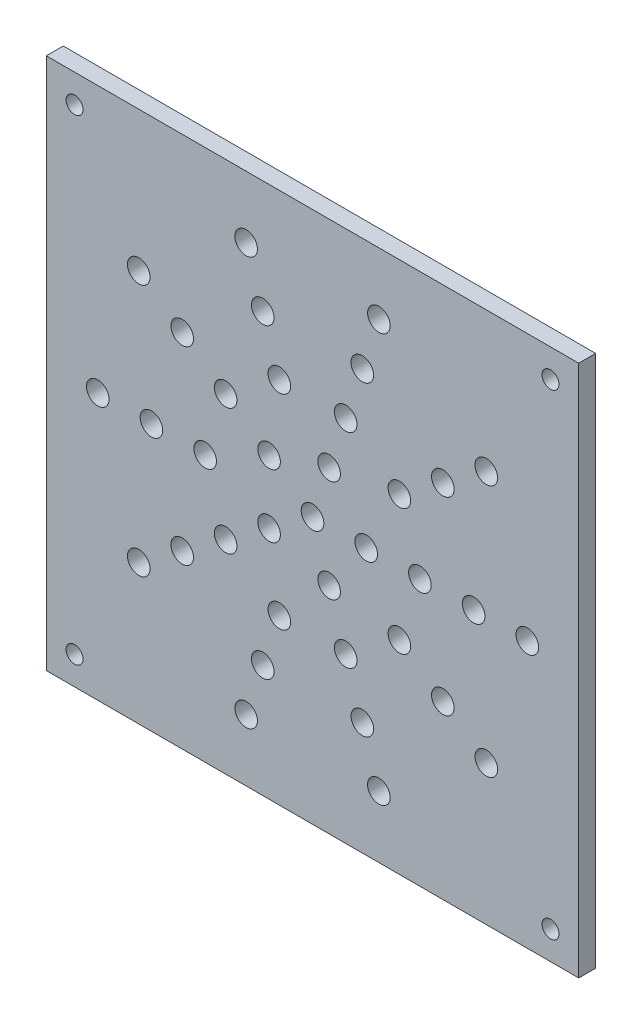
ISO-10303-21;
HEADER;
FILE_DESCRIPTION(('STEP AP214'),'2;1');
FILE_NAME('part.step','',(''),(''),'','','');
FILE_SCHEMA(('AUTOMOTIVE_DESIGN { 1 0 10303 214 1 1 1 1 }'));
ENDSEC;
DATA;
#1=APPLICATION_CONTEXT('core data for automotive mechanical design processes');
#2=APPLICATION_PROTOCOL_DEFINITION('international standard','automotive_design',2000,#1);
#3=PRODUCT_CONTEXT('',#1,'mechanical');
#4=PRODUCT('Part','Part','',(#3));
#5=PRODUCT_RELATED_PRODUCT_CATEGORY('part','',(#4));
#6=PRODUCT_DEFINITION_FORMATION('','',#4);
#7=PRODUCT_DEFINITION_CONTEXT('part definition',#1,'design');
#8=PRODUCT_DEFINITION('design','',#6,#7);
#9=PRODUCT_DEFINITION_SHAPE('','',#8);
#10=(LENGTH_UNIT() NAMED_UNIT(*) SI_UNIT(.MILLI.,.METRE.));
#11=(NAMED_UNIT(*) PLANE_ANGLE_UNIT() SI_UNIT($,.RADIAN.));
#12=(NAMED_UNIT(*) SI_UNIT($,.STERADIAN.) SOLID_ANGLE_UNIT());
#13=UNCERTAINTY_MEASURE_WITH_UNIT(LENGTH_MEASURE(1.E-05),#10,'distance_accuracy_value','');
#14=(GEOMETRIC_REPRESENTATION_CONTEXT(3) GLOBAL_UNCERTAINTY_ASSIGNED_CONTEXT((#13)) GLOBAL_UNIT_ASSIGNED_CONTEXT((#10,
#11,#12)) REPRESENTATION_CONTEXT('',''));
#15=CARTESIAN_POINT('',(0.,0.,0.));
#16=DIRECTION('',(0.,0.,1.));
#17=DIRECTION('',(1.,0.,0.));
#18=AXIS2_PLACEMENT_3D('',#15,#16,#17);
#19=CARTESIAN_POINT('',(89.2000000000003,-3.15388196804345E-13,3.));
#20=DIRECTION('',(1.,0.,0.));
#21=DIRECTION('',(0.,1.,0.));
#22=AXIS2_PLACEMENT_3D('',#19,#20,#21);
#23=PLANE('',#22);
#24=DIRECTION('',(0.,-1.,0.));
#25=VECTOR('',#24,1.);
#26=CARTESIAN_POINT('',(89.2000000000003,-3.15388196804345E-13,0.));
#27=LINE('',#26,#25);
#28=CARTESIAN_POINT('',(89.2000000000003,4.99999999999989,0.));
#29=VERTEX_POINT('',#28);
#30=CARTESIAN_POINT('',(89.2,-89.2000000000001,0.));
#31=VERTEX_POINT('',#30);
#32=EDGE_CURVE('E231',#29,#31,#27,.T.);
#33=ORIENTED_EDGE('',*,*,#32,.F.);
#34=DIRECTION('',(0.,0.,-1.));
#35=VECTOR('',#34,1.);
#36=CARTESIAN_POINT('',(89.2000000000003,4.99999999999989,3.));
#37=LINE('',#36,#35);
#38=CARTESIAN_POINT('',(89.2000000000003,4.99999999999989,3.));
#39=VERTEX_POINT('',#38);
#40=EDGE_CURVE('E11',#39,#29,#37,.T.);
#41=ORIENTED_EDGE('',*,*,#40,.F.);
#42=DIRECTION('',(0.,-1.,0.));
#43=VECTOR('',#42,1.);
#44=CARTESIAN_POINT('',(89.2000000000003,-3.15388196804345E-13,3.));
#45=LINE('',#44,#43);
#46=CARTESIAN_POINT('',(89.2,-89.2000000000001,3.));
#47=VERTEX_POINT('',#46);
#48=EDGE_CURVE('E96',#39,#47,#45,.T.);
#49=ORIENTED_EDGE('',*,*,#48,.T.);
#50=DIRECTION('',(0.,0.,-1.));
#51=VECTOR('',#50,1.);
#52=CARTESIAN_POINT('',(89.2,-89.2000000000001,3.));
#53=LINE('',#52,#51);
#54=EDGE_CURVE('E64',#47,#31,#53,.T.);
#55=ORIENTED_EDGE('',*,*,#54,.T.);
#56=EDGE_LOOP('',(#33,#41,#49,#55));
#57=FACE_BOUND('',#56,.T.);
#58=ADVANCED_FACE('F47',(#57),#23,.T.);
#59=CARTESIAN_POINT('',(0.,5.0000000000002,3.));
#60=DIRECTION('',(0.,-1.,0.));
#61=DIRECTION('',(1.,0.,0.));
#62=AXIS2_PLACEMENT_3D('',#59,#60,#61);
#63=PLANE('',#62);
#64=DIRECTION('',(-1.,0.,0.));
#65=VECTOR('',#64,1.);
#66=CARTESIAN_POINT('',(0.,5.0000000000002,0.));
#67=LINE('',#66,#65);
#68=CARTESIAN_POINT('',(-4.99999999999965,5.00000000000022,0.));
#69=VERTEX_POINT('',#68);
#70=EDGE_CURVE('E102',#29,#69,#67,.T.);
#71=ORIENTED_EDGE('',*,*,#70,.T.);
#72=DIRECTION('',(0.,0.,-1.));
#73=VECTOR('',#72,1.);
#74=CARTESIAN_POINT('',(-4.99999999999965,5.00000000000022,3.));
#75=LINE('',#74,#73);
#76=CARTESIAN_POINT('',(-4.99999999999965,5.00000000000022,3.));
#77=VERTEX_POINT('',#76);
#78=EDGE_CURVE('E56',#77,#69,#75,.T.);
#79=ORIENTED_EDGE('',*,*,#78,.F.);
#80=DIRECTION('',(-1.,0.,0.));
#81=VECTOR('',#80,1.);
#82=CARTESIAN_POINT('',(0.,5.0000000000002,3.));
#83=LINE('',#82,#81);
#84=EDGE_CURVE('E90',#39,#77,#83,.T.);
#85=ORIENTED_EDGE('',*,*,#84,.F.);
#86=ORIENTED_EDGE('',*,*,#40,.T.);
#87=EDGE_LOOP('',(#71,#79,#85,#86));
#88=FACE_BOUND('',#87,.T.);
#89=ADVANCED_FACE('F100',(#88),#63,.F.);
#90=CARTESIAN_POINT('',(-4.99999999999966,0.,3.));
#91=DIRECTION('',(-1.,0.,0.));
#92=DIRECTION('',(0.,-1.,0.));
#93=AXIS2_PLACEMENT_3D('',#90,#91,#92);
#94=PLANE('',#93);
#95=DIRECTION('',(0.,1.,0.));
#96=VECTOR('',#95,1.);
#97=CARTESIAN_POINT('',(-4.99999999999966,0.,0.));
#98=LINE('',#97,#96);
#99=CARTESIAN_POINT('',(-4.99999999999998,-89.1999999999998,0.));
#100=VERTEX_POINT('',#99);
#101=EDGE_CURVE('E234',#100,#69,#98,.T.);
#102=ORIENTED_EDGE('',*,*,#101,.F.);
#103=DIRECTION('',(0.,0.,-1.));
#104=VECTOR('',#103,1.);
#105=CARTESIAN_POINT('',(-4.99999999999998,-89.1999999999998,3.));
#106=LINE('',#105,#104);
#107=CARTESIAN_POINT('',(-4.99999999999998,-89.1999999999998,3.));
#108=VERTEX_POINT('',#107);
#109=EDGE_CURVE('E77',#108,#100,#106,.T.);
#110=ORIENTED_EDGE('',*,*,#109,.F.);
#111=DIRECTION('',(0.,1.,0.));
#112=VECTOR('',#111,1.);
#113=CARTESIAN_POINT('',(-4.99999999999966,0.,3.));
#114=LINE('',#113,#112);
#115=EDGE_CURVE('E95',#108,#77,#114,.T.);
#116=ORIENTED_EDGE('',*,*,#115,.T.);
#117=ORIENTED_EDGE('',*,*,#78,.T.);
#118=EDGE_LOOP('',(#102,#110,#116,#117));
#119=FACE_BOUND('',#118,.T.);
#120=ADVANCED_FACE('F105',(#119),#94,.T.);
#121=CARTESIAN_POINT('',(0.,0.,3.));
#122=DIRECTION('',(0.,0.,-1.));
#123=DIRECTION('',(-1.,0.,0.));
#124=AXIS2_PLACEMENT_3D('',#121,#122,#123);
#125=CYLINDRICAL_SURFACE('',#124,1.5);
#126=CARTESIAN_POINT('',(0.,0.,3.));
#127=DIRECTION('',(0.,0.,1.));
#128=DIRECTION('',(1.,0.,0.));
#129=AXIS2_PLACEMENT_3D('',#126,#127,#128);
#130=CIRCLE('',#129,1.5);
#131=CARTESIAN_POINT('',(1.50000000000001,0.,3.));
#132=VERTEX_POINT('',#131);
#133=EDGE_CURVE('E361',#132,#132,#130,.T.);
#134=ORIENTED_EDGE('',*,*,#133,.T.);
#135=EDGE_LOOP('',(#134));
#136=FACE_BOUND('',#135,.T.);
#137=CARTESIAN_POINT('',(0.,0.,0.));
#138=DIRECTION('',(0.,0.,1.));
#139=DIRECTION('',(1.,0.,0.));
#140=AXIS2_PLACEMENT_3D('',#137,#138,#139);
#141=CIRCLE('',#140,1.5);
#142=CARTESIAN_POINT('',(1.50000000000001,0.,0.));
#143=VERTEX_POINT('',#142);
#144=EDGE_CURVE('E228',#143,#143,#141,.T.);
#145=ORIENTED_EDGE('',*,*,#144,.F.);
#146=EDGE_LOOP('',(#145));
#147=FACE_BOUND('',#146,.T.);
#148=ADVANCED_FACE('F383',(#136,#147),#125,.F.);
#149=CARTESIAN_POINT('',(8.83731317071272E-13,-84.2,3.));
#150=DIRECTION('',(0.,0.,-1.));
#151=DIRECTION('',(-1.,0.,0.));
#152=AXIS2_PLACEMENT_3D('',#149,#150,#151);
#153=CYLINDRICAL_SURFACE('',#152,1.5);
#154=CARTESIAN_POINT('',(8.83731317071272E-13,-84.2,3.));
#155=DIRECTION('',(0.,0.,1.));
#156=DIRECTION('',(1.,0.,0.));
#157=AXIS2_PLACEMENT_3D('',#154,#155,#156);
#158=CIRCLE('',#157,1.5);
#159=CARTESIAN_POINT('',(1.50000000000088,-84.2,3.));
#160=VERTEX_POINT('',#159);
#161=EDGE_CURVE('E358',#160,#160,#158,.T.);
#162=ORIENTED_EDGE('',*,*,#161,.T.);
#163=EDGE_LOOP('',(#162));
#164=FACE_BOUND('',#163,.T.);
#165=CARTESIAN_POINT('',(8.83731317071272E-13,-84.2,0.));
#166=DIRECTION('',(0.,0.,1.));
#167=DIRECTION('',(1.,0.,0.));
#168=AXIS2_PLACEMENT_3D('',#165,#166,#167);
#169=CIRCLE('',#168,1.5);
#170=CARTESIAN_POINT('',(1.50000000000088,-84.2,0.));
#171=VERTEX_POINT('',#170);
#172=EDGE_CURVE('E225',#171,#171,#169,.T.);
#173=ORIENTED_EDGE('',*,*,#172,.F.);
#174=EDGE_LOOP('',(#173));
#175=FACE_BOUND('',#174,.T.);
#176=ADVANCED_FACE('F386',(#164,#175),#153,.F.);
#177=CARTESIAN_POINT('',(84.2000000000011,-84.1999999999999,3.));
#178=DIRECTION('',(0.,0.,-1.));
#179=DIRECTION('',(-1.,0.,0.));
#180=AXIS2_PLACEMENT_3D('',#177,#178,#179);
#181=CYLINDRICAL_SURFACE('',#180,1.5);
#182=CARTESIAN_POINT('',(84.2000000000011,-84.1999999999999,3.));
#183=DIRECTION('',(0.,0.,1.));
#184=DIRECTION('',(1.,0.,0.));
#185=AXIS2_PLACEMENT_3D('',#182,#183,#184);
#186=CIRCLE('',#185,1.5);
#187=CARTESIAN_POINT('',(85.7000000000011,-84.1999999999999,3.));
#188=VERTEX_POINT('',#187);
#189=EDGE_CURVE('E355',#188,#188,#186,.T.);
#190=ORIENTED_EDGE('',*,*,#189,.T.);
#191=EDGE_LOOP('',(#190));
#192=FACE_BOUND('',#191,.T.);
#193=CARTESIAN_POINT('',(84.2000000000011,-84.1999999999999,0.));
#194=DIRECTION('',(0.,0.,1.));
#195=DIRECTION('',(1.,0.,0.));
#196=AXIS2_PLACEMENT_3D('',#193,#194,#195);
#197=CIRCLE('',#196,1.5);
#198=CARTESIAN_POINT('',(85.7000000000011,-84.1999999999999,0.));
#199=VERTEX_POINT('',#198);
#200=EDGE_CURVE('E222',#199,#199,#197,.T.);
#201=ORIENTED_EDGE('',*,*,#200,.F.);
#202=EDGE_LOOP('',(#201));
#203=FACE_BOUND('',#202,.T.);
#204=ADVANCED_FACE('F390',(#192,#203),#181,.F.);
#205=CARTESIAN_POINT('',(84.2000000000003,0.,3.));
#206=DIRECTION('',(0.,0.,-1.));
#207=DIRECTION('',(-1.,0.,0.));
#208=AXIS2_PLACEMENT_3D('',#205,#206,#207);
#209=CYLINDRICAL_SURFACE('',#208,1.5);
#210=CARTESIAN_POINT('',(84.2000000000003,0.,3.));
#211=DIRECTION('',(0.,0.,1.));
#212=DIRECTION('',(1.,0.,0.));
#213=AXIS2_PLACEMENT_3D('',#210,#211,#212);
#214=CIRCLE('',#213,1.5);
#215=CARTESIAN_POINT('',(85.7000000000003,0.,3.));
#216=VERTEX_POINT('',#215);
#217=EDGE_CURVE('E352',#216,#216,#214,.T.);
#218=ORIENTED_EDGE('',*,*,#217,.T.);
#219=EDGE_LOOP('',(#218));
#220=FACE_BOUND('',#219,.T.);
#221=CARTESIAN_POINT('',(84.2000000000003,0.,0.));
#222=DIRECTION('',(0.,0.,1.));
#223=DIRECTION('',(1.,0.,0.));
#224=AXIS2_PLACEMENT_3D('',#221,#222,#223);
#225=CIRCLE('',#224,1.5);
#226=CARTESIAN_POINT('',(85.7000000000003,0.,0.));
#227=VERTEX_POINT('',#226);
#228=EDGE_CURVE('E219',#227,#227,#225,.T.);
#229=ORIENTED_EDGE('',*,*,#228,.F.);
#230=EDGE_LOOP('',(#229));
#231=FACE_BOUND('',#230,.T.);
#232=ADVANCED_FACE('F394',(#220,#231),#209,.F.);
#233=CARTESIAN_POINT('',(42.1000000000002,-42.1,3.));
#234=DIRECTION('',(0.,0.,-1.));
#235=DIRECTION('',(-1.,0.,0.));
#236=AXIS2_PLACEMENT_3D('',#233,#234,#235);
#237=CYLINDRICAL_SURFACE('',#236,2.);
#238=CARTESIAN_POINT('',(42.1000000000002,-42.1,3.));
#239=DIRECTION('',(0.,0.,1.));
#240=DIRECTION('',(1.,0.,0.));
#241=AXIS2_PLACEMENT_3D('',#238,#239,#240);
#242=CIRCLE('',#241,2.);
#243=CARTESIAN_POINT('',(44.1000000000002,-42.1,3.));
#244=VERTEX_POINT('',#243);
#245=EDGE_CURVE('E349',#244,#244,#242,.T.);
#246=ORIENTED_EDGE('',*,*,#245,.T.);
#247=EDGE_LOOP('',(#246));
#248=FACE_BOUND('',#247,.T.);
#249=CARTESIAN_POINT('',(42.1000000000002,-42.1,0.));
#250=DIRECTION('',(0.,0.,1.));
#251=DIRECTION('',(1.,0.,0.));
#252=AXIS2_PLACEMENT_3D('',#249,#250,#251);
#253=CIRCLE('',#252,2.);
#254=CARTESIAN_POINT('',(44.1000000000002,-42.1,0.));
#255=VERTEX_POINT('',#254);
#256=EDGE_CURVE('E216',#255,#255,#253,.T.);
#257=ORIENTED_EDGE('',*,*,#256,.F.);
#258=EDGE_LOOP('',(#257));
#259=FACE_BOUND('',#258,.T.);
#260=ADVANCED_FACE('F398',(#248,#259),#237,.F.);
#261=CARTESIAN_POINT('',(51.6000000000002,-42.1,3.));
#262=DIRECTION('',(0.,0.,-1.));
#263=DIRECTION('',(-1.,0.,0.));
#264=AXIS2_PLACEMENT_3D('',#261,#262,#263);
#265=CYLINDRICAL_SURFACE('',#264,2.);
#266=CARTESIAN_POINT('',(51.6000000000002,-42.1,3.));
#267=DIRECTION('',(0.,0.,1.));
#268=DIRECTION('',(1.,0.,0.));
#269=AXIS2_PLACEMENT_3D('',#266,#267,#268);
#270=CIRCLE('',#269,2.);
#271=CARTESIAN_POINT('',(53.6000000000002,-42.1,3.));
#272=VERTEX_POINT('',#271);
#273=EDGE_CURVE('E346',#272,#272,#270,.T.);
#274=ORIENTED_EDGE('',*,*,#273,.T.);
#275=EDGE_LOOP('',(#274));
#276=FACE_BOUND('',#275,.T.);
#277=CARTESIAN_POINT('',(51.6000000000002,-42.1,0.));
#278=DIRECTION('',(0.,0.,1.));
#279=DIRECTION('',(1.,0.,0.));
#280=AXIS2_PLACEMENT_3D('',#277,#278,#279);
#281=CIRCLE('',#280,2.);
#282=CARTESIAN_POINT('',(53.6000000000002,-42.1,0.));
#283=VERTEX_POINT('',#282);
#284=EDGE_CURVE('E213',#283,#283,#281,.T.);
#285=ORIENTED_EDGE('',*,*,#284,.F.);
#286=EDGE_LOOP('',(#285));
#287=FACE_BOUND('',#286,.T.);
#288=ADVANCED_FACE('F402',(#276,#287),#265,.F.);
#289=CARTESIAN_POINT('',(61.1000000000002,-42.1,3.));
#290=DIRECTION('',(0.,0.,-1.));
#291=DIRECTION('',(-1.,0.,0.));
#292=AXIS2_PLACEMENT_3D('',#289,#290,#291);
#293=CYLINDRICAL_SURFACE('',#292,2.);
#294=CARTESIAN_POINT('',(61.1000000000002,-42.1,3.));
#295=DIRECTION('',(0.,0.,1.));
#296=DIRECTION('',(1.,0.,0.));
#297=AXIS2_PLACEMENT_3D('',#294,#295,#296);
#298=CIRCLE('',#297,2.);
#299=CARTESIAN_POINT('',(63.1000000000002,-42.1,3.));
#300=VERTEX_POINT('',#299);
#301=EDGE_CURVE('E343',#300,#300,#298,.T.);
#302=ORIENTED_EDGE('',*,*,#301,.T.);
#303=EDGE_LOOP('',(#302));
#304=FACE_BOUND('',#303,.T.);
#305=CARTESIAN_POINT('',(61.1000000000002,-42.1,0.));
#306=DIRECTION('',(0.,0.,1.));
#307=DIRECTION('',(1.,0.,0.));
#308=AXIS2_PLACEMENT_3D('',#305,#306,#307);
#309=CIRCLE('',#308,2.);
#310=CARTESIAN_POINT('',(63.1000000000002,-42.1,0.));
#311=VERTEX_POINT('',#310);
#312=EDGE_CURVE('E210',#311,#311,#309,.T.);
#313=ORIENTED_EDGE('',*,*,#312,.F.);
#314=EDGE_LOOP('',(#313));
#315=FACE_BOUND('',#314,.T.);
#316=ADVANCED_FACE('F406',(#304,#315),#293,.F.);
#317=CARTESIAN_POINT('',(70.6000000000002,-42.1,3.));
#318=DIRECTION('',(0.,0.,-1.));
#319=DIRECTION('',(-1.,0.,0.));
#320=AXIS2_PLACEMENT_3D('',#317,#318,#319);
#321=CYLINDRICAL_SURFACE('',#320,2.);
#322=CARTESIAN_POINT('',(70.6000000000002,-42.1,3.));
#323=DIRECTION('',(0.,0.,1.));
#324=DIRECTION('',(1.,0.,0.));
#325=AXIS2_PLACEMENT_3D('',#322,#323,#324);
#326=CIRCLE('',#325,2.);
#327=CARTESIAN_POINT('',(72.6000000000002,-42.1,3.));
#328=VERTEX_POINT('',#327);
#329=EDGE_CURVE('E340',#328,#328,#326,.T.);
#330=ORIENTED_EDGE('',*,*,#329,.T.);
#331=EDGE_LOOP('',(#330));
#332=FACE_BOUND('',#331,.T.);
#333=CARTESIAN_POINT('',(70.6000000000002,-42.1,0.));
#334=DIRECTION('',(0.,0.,1.));
#335=DIRECTION('',(1.,0.,0.));
#336=AXIS2_PLACEMENT_3D('',#333,#334,#335);
#337=CIRCLE('',#336,2.);
#338=CARTESIAN_POINT('',(72.6000000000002,-42.1,0.));
#339=VERTEX_POINT('',#338);
#340=EDGE_CURVE('E207',#339,#339,#337,.T.);
#341=ORIENTED_EDGE('',*,*,#340,.F.);
#342=EDGE_LOOP('',(#341));
#343=FACE_BOUND('',#342,.T.);
#344=ADVANCED_FACE('F410',(#332,#343),#321,.F.);
#345=CARTESIAN_POINT('',(80.1000000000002,-42.1,3.));
#346=DIRECTION('',(0.,0.,-1.));
#347=DIRECTION('',(-1.,0.,0.));
#348=AXIS2_PLACEMENT_3D('',#345,#346,#347);
#349=CYLINDRICAL_SURFACE('',#348,2.);
#350=CARTESIAN_POINT('',(80.1000000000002,-42.1,3.));
#351=DIRECTION('',(0.,0.,1.));
#352=DIRECTION('',(1.,0.,0.));
#353=AXIS2_PLACEMENT_3D('',#350,#351,#352);
#354=CIRCLE('',#353,2.);
#355=CARTESIAN_POINT('',(82.1000000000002,-42.1,3.));
#356=VERTEX_POINT('',#355);
#357=EDGE_CURVE('E337',#356,#356,#354,.T.);
#358=ORIENTED_EDGE('',*,*,#357,.T.);
#359=EDGE_LOOP('',(#358));
#360=FACE_BOUND('',#359,.T.);
#361=CARTESIAN_POINT('',(80.1000000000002,-42.1,0.));
#362=DIRECTION('',(0.,0.,1.));
#363=DIRECTION('',(1.,0.,0.));
#364=AXIS2_PLACEMENT_3D('',#361,#362,#363);
#365=CIRCLE('',#364,2.);
#366=CARTESIAN_POINT('',(82.1000000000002,-42.1,0.));
#367=VERTEX_POINT('',#366);
#368=EDGE_CURVE('E204',#367,#367,#365,.T.);
#369=ORIENTED_EDGE('',*,*,#368,.F.);
#370=EDGE_LOOP('',(#369));
#371=FACE_BOUND('',#370,.T.);
#372=ADVANCED_FACE('F414',(#360,#371),#349,.F.);
#373=CARTESIAN_POINT('',(57.4713228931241,-53.267919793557,3.));
#374=DIRECTION('',(0.,0.,-1.));
#375=DIRECTION('',(-1.,0.,0.));
#376=AXIS2_PLACEMENT_3D('',#373,#374,#375);
#377=CYLINDRICAL_SURFACE('',#376,2.);
#378=CARTESIAN_POINT('',(57.4713228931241,-53.267919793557,3.));
#379=DIRECTION('',(0.,0.,1.));
#380=DIRECTION('',(1.,0.,0.));
#381=AXIS2_PLACEMENT_3D('',#378,#379,#380);
#382=CIRCLE('',#381,2.);
#383=CARTESIAN_POINT('',(59.4713228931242,-53.267919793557,3.));
#384=VERTEX_POINT('',#383);
#385=EDGE_CURVE('E334',#384,#384,#382,.T.);
#386=ORIENTED_EDGE('',*,*,#385,.T.);
#387=EDGE_LOOP('',(#386));
#388=FACE_BOUND('',#387,.T.);
#389=CARTESIAN_POINT('',(57.4713228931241,-53.267919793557,0.));
#390=DIRECTION('',(0.,0.,1.));
#391=DIRECTION('',(1.,0.,0.));
#392=AXIS2_PLACEMENT_3D('',#389,#390,#391);
#393=CIRCLE('',#392,2.);
#394=CARTESIAN_POINT('',(59.4713228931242,-53.267919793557,0.));
#395=VERTEX_POINT('',#394);
#396=EDGE_CURVE('E201',#395,#395,#393,.T.);
#397=ORIENTED_EDGE('',*,*,#396,.F.);
#398=EDGE_LOOP('',(#397));
#399=FACE_BOUND('',#398,.T.);
#400=ADVANCED_FACE('F418',(#388,#399),#377,.F.);
#401=CARTESIAN_POINT('',(65.1569843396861,-58.8518796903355,3.));
#402=DIRECTION('',(0.,0.,-1.));
#403=DIRECTION('',(-1.,0.,0.));
#404=AXIS2_PLACEMENT_3D('',#401,#402,#403);
#405=CYLINDRICAL_SURFACE('',#404,2.);
#406=CARTESIAN_POINT('',(65.1569843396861,-58.8518796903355,3.));
#407=DIRECTION('',(0.,0.,1.));
#408=DIRECTION('',(1.,0.,0.));
#409=AXIS2_PLACEMENT_3D('',#406,#407,#408);
#410=CIRCLE('',#409,2.);
#411=CARTESIAN_POINT('',(67.1569843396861,-58.8518796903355,3.));
#412=VERTEX_POINT('',#411);
#413=EDGE_CURVE('E331',#412,#412,#410,.T.);
#414=ORIENTED_EDGE('',*,*,#413,.T.);
#415=EDGE_LOOP('',(#414));
#416=FACE_BOUND('',#415,.T.);
#417=CARTESIAN_POINT('',(65.1569843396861,-58.8518796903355,0.));
#418=DIRECTION('',(0.,0.,1.));
#419=DIRECTION('',(1.,0.,0.));
#420=AXIS2_PLACEMENT_3D('',#417,#418,#419);
#421=CIRCLE('',#420,2.);
#422=CARTESIAN_POINT('',(67.1569843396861,-58.8518796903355,0.));
#423=VERTEX_POINT('',#422);
#424=EDGE_CURVE('E198',#423,#423,#421,.T.);
#425=ORIENTED_EDGE('',*,*,#424,.F.);
#426=EDGE_LOOP('',(#425));
#427=FACE_BOUND('',#426,.T.);
#428=ADVANCED_FACE('F422',(#416,#427),#405,.F.);
#429=CARTESIAN_POINT('',(72.8426457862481,-64.435839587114,3.));
#430=DIRECTION('',(0.,0.,-1.));
#431=DIRECTION('',(-1.,0.,0.));
#432=AXIS2_PLACEMENT_3D('',#429,#430,#431);
#433=CYLINDRICAL_SURFACE('',#432,2.);
#434=CARTESIAN_POINT('',(72.8426457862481,-64.435839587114,3.));
#435=DIRECTION('',(0.,0.,1.));
#436=DIRECTION('',(1.,0.,0.));
#437=AXIS2_PLACEMENT_3D('',#434,#435,#436);
#438=CIRCLE('',#437,2.);
#439=CARTESIAN_POINT('',(74.8426457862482,-64.435839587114,3.));
#440=VERTEX_POINT('',#439);
#441=EDGE_CURVE('E328',#440,#440,#438,.T.);
#442=ORIENTED_EDGE('',*,*,#441,.T.);
#443=EDGE_LOOP('',(#442));
#444=FACE_BOUND('',#443,.T.);
#445=CARTESIAN_POINT('',(72.8426457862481,-64.435839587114,0.));
#446=DIRECTION('',(0.,0.,1.));
#447=DIRECTION('',(1.,0.,0.));
#448=AXIS2_PLACEMENT_3D('',#445,#446,#447);
#449=CIRCLE('',#448,2.);
#450=CARTESIAN_POINT('',(74.8426457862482,-64.435839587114,0.));
#451=VERTEX_POINT('',#450);
#452=EDGE_CURVE('E195',#451,#451,#449,.T.);
#453=ORIENTED_EDGE('',*,*,#452,.F.);
#454=EDGE_LOOP('',(#453));
#455=FACE_BOUND('',#454,.T.);
#456=ADVANCED_FACE('F426',(#444,#455),#433,.F.);
#457=CARTESIAN_POINT('',(45.0356614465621,-51.1350369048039,3.));
#458=DIRECTION('',(0.,0.,-1.));
#459=DIRECTION('',(-1.,0.,0.));
#460=AXIS2_PLACEMENT_3D('',#457,#458,#459);
#461=CYLINDRICAL_SURFACE('',#460,2.00000000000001);
#462=CARTESIAN_POINT('',(45.0356614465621,-51.1350369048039,3.));
#463=DIRECTION('',(0.,0.,1.));
#464=DIRECTION('',(1.,0.,0.));
#465=AXIS2_PLACEMENT_3D('',#462,#463,#464);
#466=CIRCLE('',#465,2.00000000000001);
#467=CARTESIAN_POINT('',(47.0356614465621,-51.1350369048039,3.));
#468=VERTEX_POINT('',#467);
#469=EDGE_CURVE('E325',#468,#468,#466,.T.);
#470=ORIENTED_EDGE('',*,*,#469,.T.);
#471=EDGE_LOOP('',(#470));
#472=FACE_BOUND('',#471,.T.);
#473=CARTESIAN_POINT('',(45.0356614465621,-51.1350369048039,0.));
#474=DIRECTION('',(0.,0.,1.));
#475=DIRECTION('',(1.,0.,0.));
#476=AXIS2_PLACEMENT_3D('',#473,#474,#475);
#477=CIRCLE('',#476,2.00000000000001);
#478=CARTESIAN_POINT('',(47.0356614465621,-51.1350369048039,0.));
#479=VERTEX_POINT('',#478);
#480=EDGE_CURVE('E192',#479,#479,#477,.T.);
#481=ORIENTED_EDGE('',*,*,#480,.F.);
#482=EDGE_LOOP('',(#481));
#483=FACE_BOUND('',#482,.T.);
#484=ADVANCED_FACE('F430',(#472,#483),#461,.F.);
#485=CARTESIAN_POINT('',(47.9713228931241,-60.1700738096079,3.));
#486=DIRECTION('',(0.,0.,-1.));
#487=DIRECTION('',(-1.,0.,0.));
#488=AXIS2_PLACEMENT_3D('',#485,#486,#487);
#489=CYLINDRICAL_SURFACE('',#488,2.);
#490=CARTESIAN_POINT('',(47.9713228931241,-60.1700738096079,3.));
#491=DIRECTION('',(0.,0.,1.));
#492=DIRECTION('',(1.,0.,0.));
#493=AXIS2_PLACEMENT_3D('',#490,#491,#492);
#494=CIRCLE('',#493,2.);
#495=CARTESIAN_POINT('',(49.9713228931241,-60.1700738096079,3.));
#496=VERTEX_POINT('',#495);
#497=EDGE_CURVE('E322',#496,#496,#494,.T.);
#498=ORIENTED_EDGE('',*,*,#497,.T.);
#499=EDGE_LOOP('',(#498));
#500=FACE_BOUND('',#499,.T.);
#501=CARTESIAN_POINT('',(47.9713228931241,-60.1700738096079,0.));
#502=DIRECTION('',(0.,0.,1.));
#503=DIRECTION('',(1.,0.,0.));
#504=AXIS2_PLACEMENT_3D('',#501,#502,#503);
#505=CIRCLE('',#504,2.);
#506=CARTESIAN_POINT('',(49.9713228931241,-60.1700738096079,0.));
#507=VERTEX_POINT('',#506);
#508=EDGE_CURVE('E189',#507,#507,#505,.T.);
#509=ORIENTED_EDGE('',*,*,#508,.F.);
#510=EDGE_LOOP('',(#509));
#511=FACE_BOUND('',#510,.T.);
#512=ADVANCED_FACE('F434',(#500,#511),#489,.F.);
#513=CARTESIAN_POINT('',(50.9069843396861,-69.2051107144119,3.));
#514=DIRECTION('',(0.,0.,-1.));
#515=DIRECTION('',(-1.,0.,0.));
#516=AXIS2_PLACEMENT_3D('',#513,#514,#515);
#517=CYLINDRICAL_SURFACE('',#516,2.);
#518=CARTESIAN_POINT('',(50.9069843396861,-69.2051107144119,3.));
#519=DIRECTION('',(0.,0.,1.));
#520=DIRECTION('',(1.,0.,0.));
#521=AXIS2_PLACEMENT_3D('',#518,#519,#520);
#522=CIRCLE('',#521,2.);
#523=CARTESIAN_POINT('',(52.9069843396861,-69.2051107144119,3.));
#524=VERTEX_POINT('',#523);
#525=EDGE_CURVE('E319',#524,#524,#522,.T.);
#526=ORIENTED_EDGE('',*,*,#525,.T.);
#527=EDGE_LOOP('',(#526));
#528=FACE_BOUND('',#527,.T.);
#529=CARTESIAN_POINT('',(50.9069843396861,-69.2051107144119,0.));
#530=DIRECTION('',(0.,0.,1.));
#531=DIRECTION('',(1.,0.,0.));
#532=AXIS2_PLACEMENT_3D('',#529,#530,#531);
#533=CIRCLE('',#532,2.);
#534=CARTESIAN_POINT('',(52.9069843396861,-69.2051107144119,0.));
#535=VERTEX_POINT('',#534);
#536=EDGE_CURVE('E186',#535,#535,#533,.T.);
#537=ORIENTED_EDGE('',*,*,#536,.F.);
#538=EDGE_LOOP('',(#537));
#539=FACE_BOUND('',#538,.T.);
#540=ADVANCED_FACE('F438',(#528,#539),#517,.F.);
#541=CARTESIAN_POINT('',(53.8426457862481,-78.2401476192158,3.));
#542=DIRECTION('',(0.,0.,-1.));
#543=DIRECTION('',(-1.,0.,0.));
#544=AXIS2_PLACEMENT_3D('',#541,#542,#543);
#545=CYLINDRICAL_SURFACE('',#544,2.);
#546=CARTESIAN_POINT('',(53.8426457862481,-78.2401476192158,3.));
#547=DIRECTION('',(0.,0.,1.));
#548=DIRECTION('',(1.,0.,0.));
#549=AXIS2_PLACEMENT_3D('',#546,#547,#548);
#550=CIRCLE('',#549,2.);
#551=CARTESIAN_POINT('',(55.8426457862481,-78.2401476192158,3.));
#552=VERTEX_POINT('',#551);
#553=EDGE_CURVE('E316',#552,#552,#550,.T.);
#554=ORIENTED_EDGE('',*,*,#553,.T.);
#555=EDGE_LOOP('',(#554));
#556=FACE_BOUND('',#555,.T.);
#557=CARTESIAN_POINT('',(53.8426457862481,-78.2401476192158,0.));
#558=DIRECTION('',(0.,0.,1.));
#559=DIRECTION('',(1.,0.,0.));
#560=AXIS2_PLACEMENT_3D('',#557,#558,#559);
#561=CIRCLE('',#560,2.);
#562=CARTESIAN_POINT('',(55.8426457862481,-78.2401476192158,0.));
#563=VERTEX_POINT('',#562);
#564=EDGE_CURVE('E183',#563,#563,#561,.T.);
#565=ORIENTED_EDGE('',*,*,#564,.F.);
#566=EDGE_LOOP('',(#565));
#567=FACE_BOUND('',#566,.T.);
#568=ADVANCED_FACE('F442',(#556,#567),#545,.F.);
#569=CARTESIAN_POINT('',(36.2286771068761,-60.1700738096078,3.));
#570=DIRECTION('',(0.,0.,-1.));
#571=DIRECTION('',(-1.,0.,0.));
#572=AXIS2_PLACEMENT_3D('',#569,#570,#571);
#573=CYLINDRICAL_SURFACE('',#572,2.);
#574=CARTESIAN_POINT('',(36.2286771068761,-60.1700738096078,3.));
#575=DIRECTION('',(0.,0.,1.));
#576=DIRECTION('',(1.,0.,0.));
#577=AXIS2_PLACEMENT_3D('',#574,#575,#576);
#578=CIRCLE('',#577,2.);
#579=CARTESIAN_POINT('',(38.2286771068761,-60.1700738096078,3.));
#580=VERTEX_POINT('',#579);
#581=EDGE_CURVE('E313',#580,#580,#578,.T.);
#582=ORIENTED_EDGE('',*,*,#581,.T.);
#583=EDGE_LOOP('',(#582));
#584=FACE_BOUND('',#583,.T.);
#585=CARTESIAN_POINT('',(36.2286771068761,-60.1700738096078,0.));
#586=DIRECTION('',(0.,0.,1.));
#587=DIRECTION('',(1.,0.,0.));
#588=AXIS2_PLACEMENT_3D('',#585,#586,#587);
#589=CIRCLE('',#588,2.);
#590=CARTESIAN_POINT('',(38.2286771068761,-60.1700738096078,0.));
#591=VERTEX_POINT('',#590);
#592=EDGE_CURVE('E180',#591,#591,#589,.T.);
#593=ORIENTED_EDGE('',*,*,#592,.F.);
#594=EDGE_LOOP('',(#593));
#595=FACE_BOUND('',#594,.T.);
#596=ADVANCED_FACE('F446',(#584,#595),#573,.F.);
#597=CARTESIAN_POINT('',(33.293015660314,-69.2051107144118,3.));
#598=DIRECTION('',(0.,0.,-1.));
#599=DIRECTION('',(-1.,0.,0.));
#600=AXIS2_PLACEMENT_3D('',#597,#598,#599);
#601=CYLINDRICAL_SURFACE('',#600,1.99999999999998);
#602=CARTESIAN_POINT('',(33.293015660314,-69.2051107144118,3.));
#603=DIRECTION('',(0.,0.,1.));
#604=DIRECTION('',(1.,0.,0.));
#605=AXIS2_PLACEMENT_3D('',#602,#603,#604);
#606=CIRCLE('',#605,1.99999999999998);
#607=CARTESIAN_POINT('',(35.293015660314,-69.2051107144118,3.));
#608=VERTEX_POINT('',#607);
#609=EDGE_CURVE('E310',#608,#608,#606,.T.);
#610=ORIENTED_EDGE('',*,*,#609,.T.);
#611=EDGE_LOOP('',(#610));
#612=FACE_BOUND('',#611,.T.);
#613=CARTESIAN_POINT('',(33.293015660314,-69.2051107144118,0.));
#614=DIRECTION('',(0.,0.,1.));
#615=DIRECTION('',(1.,0.,0.));
#616=AXIS2_PLACEMENT_3D('',#613,#614,#615);
#617=CIRCLE('',#616,1.99999999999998);
#618=CARTESIAN_POINT('',(35.293015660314,-69.2051107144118,0.));
#619=VERTEX_POINT('',#618);
#620=EDGE_CURVE('E177',#619,#619,#617,.T.);
#621=ORIENTED_EDGE('',*,*,#620,.F.);
#622=EDGE_LOOP('',(#621));
#623=FACE_BOUND('',#622,.T.);
#624=ADVANCED_FACE('F450',(#612,#623),#601,.F.);
#625=CARTESIAN_POINT('',(30.357354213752,-78.2401476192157,3.));
#626=DIRECTION('',(0.,0.,-1.));
#627=DIRECTION('',(-1.,0.,0.));
#628=AXIS2_PLACEMENT_3D('',#625,#626,#627);
#629=CYLINDRICAL_SURFACE('',#628,2.00000000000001);
#630=CARTESIAN_POINT('',(30.357354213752,-78.2401476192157,3.));
#631=DIRECTION('',(0.,0.,1.));
#632=DIRECTION('',(1.,0.,0.));
#633=AXIS2_PLACEMENT_3D('',#630,#631,#632);
#634=CIRCLE('',#633,2.00000000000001);
#635=CARTESIAN_POINT('',(32.357354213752,-78.2401476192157,3.));
#636=VERTEX_POINT('',#635);
#637=EDGE_CURVE('E307',#636,#636,#634,.T.);
#638=ORIENTED_EDGE('',*,*,#637,.T.);
#639=EDGE_LOOP('',(#638));
#640=FACE_BOUND('',#639,.T.);
#641=CARTESIAN_POINT('',(30.357354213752,-78.2401476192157,0.));
#642=DIRECTION('',(0.,0.,1.));
#643=DIRECTION('',(1.,0.,0.));
#644=AXIS2_PLACEMENT_3D('',#641,#642,#643);
#645=CIRCLE('',#644,2.00000000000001);
#646=CARTESIAN_POINT('',(32.357354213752,-78.2401476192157,0.));
#647=VERTEX_POINT('',#646);
#648=EDGE_CURVE('E174',#647,#647,#645,.T.);
#649=ORIENTED_EDGE('',*,*,#648,.F.);
#650=EDGE_LOOP('',(#649));
#651=FACE_BOUND('',#650,.T.);
#652=ADVANCED_FACE('F454',(#640,#651),#629,.F.);
#653=CARTESIAN_POINT('',(34.4143385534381,-47.6839598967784,3.));
#654=DIRECTION('',(0.,0.,-1.));
#655=DIRECTION('',(-1.,0.,0.));
#656=AXIS2_PLACEMENT_3D('',#653,#654,#655);
#657=CYLINDRICAL_SURFACE('',#656,2.);
#658=CARTESIAN_POINT('',(34.4143385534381,-47.6839598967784,3.));
#659=DIRECTION('',(0.,0.,1.));
#660=DIRECTION('',(1.,0.,0.));
#661=AXIS2_PLACEMENT_3D('',#658,#659,#660);
#662=CIRCLE('',#661,2.);
#663=CARTESIAN_POINT('',(36.4143385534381,-47.6839598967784,3.));
#664=VERTEX_POINT('',#663);
#665=EDGE_CURVE('E304',#664,#664,#662,.T.);
#666=ORIENTED_EDGE('',*,*,#665,.T.);
#667=EDGE_LOOP('',(#666));
#668=FACE_BOUND('',#667,.T.);
#669=CARTESIAN_POINT('',(34.4143385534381,-47.6839598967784,0.));
#670=DIRECTION('',(0.,0.,1.));
#671=DIRECTION('',(1.,0.,0.));
#672=AXIS2_PLACEMENT_3D('',#669,#670,#671);
#673=CIRCLE('',#672,2.);
#674=CARTESIAN_POINT('',(36.4143385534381,-47.6839598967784,0.));
#675=VERTEX_POINT('',#674);
#676=EDGE_CURVE('E171',#675,#675,#673,.T.);
#677=ORIENTED_EDGE('',*,*,#676,.F.);
#678=EDGE_LOOP('',(#677));
#679=FACE_BOUND('',#678,.T.);
#680=ADVANCED_FACE('F458',(#668,#679),#657,.F.);
#681=CARTESIAN_POINT('',(26.7286771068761,-53.2679197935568,3.));
#682=DIRECTION('',(0.,0.,-1.));
#683=DIRECTION('',(-1.,0.,0.));
#684=AXIS2_PLACEMENT_3D('',#681,#682,#683);
#685=CYLINDRICAL_SURFACE('',#684,2.);
#686=CARTESIAN_POINT('',(26.7286771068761,-53.2679197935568,3.));
#687=DIRECTION('',(0.,0.,1.));
#688=DIRECTION('',(1.,0.,0.));
#689=AXIS2_PLACEMENT_3D('',#686,#687,#688);
#690=CIRCLE('',#689,2.);
#691=CARTESIAN_POINT('',(28.7286771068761,-53.2679197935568,3.));
#692=VERTEX_POINT('',#691);
#693=EDGE_CURVE('E301',#692,#692,#690,.T.);
#694=ORIENTED_EDGE('',*,*,#693,.T.);
#695=EDGE_LOOP('',(#694));
#696=FACE_BOUND('',#695,.T.);
#697=CARTESIAN_POINT('',(26.7286771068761,-53.2679197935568,0.));
#698=DIRECTION('',(0.,0.,1.));
#699=DIRECTION('',(1.,0.,0.));
#700=AXIS2_PLACEMENT_3D('',#697,#698,#699);
#701=CIRCLE('',#700,2.);
#702=CARTESIAN_POINT('',(28.7286771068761,-53.2679197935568,0.));
#703=VERTEX_POINT('',#702);
#704=EDGE_CURVE('E168',#703,#703,#701,.T.);
#705=ORIENTED_EDGE('',*,*,#704,.F.);
#706=EDGE_LOOP('',(#705));
#707=FACE_BOUND('',#706,.T.);
#708=ADVANCED_FACE('F462',(#696,#707),#685,.F.);
#709=CARTESIAN_POINT('',(19.0430156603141,-58.8518796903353,3.));
#710=DIRECTION('',(0.,0.,-1.));
#711=DIRECTION('',(-1.,0.,0.));
#712=AXIS2_PLACEMENT_3D('',#709,#710,#711);
#713=CYLINDRICAL_SURFACE('',#712,2.00000000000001);
#714=CARTESIAN_POINT('',(19.0430156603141,-58.8518796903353,3.));
#715=DIRECTION('',(0.,0.,1.));
#716=DIRECTION('',(1.,0.,0.));
#717=AXIS2_PLACEMENT_3D('',#714,#715,#716);
#718=CIRCLE('',#717,2.00000000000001);
#719=CARTESIAN_POINT('',(21.0430156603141,-58.8518796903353,3.));
#720=VERTEX_POINT('',#719);
#721=EDGE_CURVE('E298',#720,#720,#718,.T.);
#722=ORIENTED_EDGE('',*,*,#721,.T.);
#723=EDGE_LOOP('',(#722));
#724=FACE_BOUND('',#723,.T.);
#725=CARTESIAN_POINT('',(19.0430156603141,-58.8518796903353,0.));
#726=DIRECTION('',(0.,0.,1.));
#727=DIRECTION('',(1.,0.,0.));
#728=AXIS2_PLACEMENT_3D('',#725,#726,#727);
#729=CIRCLE('',#728,2.00000000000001);
#730=CARTESIAN_POINT('',(21.0430156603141,-58.8518796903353,0.));
#731=VERTEX_POINT('',#730);
#732=EDGE_CURVE('E165',#731,#731,#729,.T.);
#733=ORIENTED_EDGE('',*,*,#732,.F.);
#734=EDGE_LOOP('',(#733));
#735=FACE_BOUND('',#734,.T.);
#736=ADVANCED_FACE('F466',(#724,#735),#713,.F.);
#737=CARTESIAN_POINT('',(11.357354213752,-64.4358395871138,3.));
#738=DIRECTION('',(0.,0.,-1.));
#739=DIRECTION('',(-1.,0.,0.));
#740=AXIS2_PLACEMENT_3D('',#737,#738,#739);
#741=CYLINDRICAL_SURFACE('',#740,2.);
#742=CARTESIAN_POINT('',(11.357354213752,-64.4358395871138,3.));
#743=DIRECTION('',(0.,0.,1.));
#744=DIRECTION('',(1.,0.,0.));
#745=AXIS2_PLACEMENT_3D('',#742,#743,#744);
#746=CIRCLE('',#745,2.);
#747=CARTESIAN_POINT('',(13.357354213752,-64.4358395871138,3.));
#748=VERTEX_POINT('',#747);
#749=EDGE_CURVE('E295',#748,#748,#746,.T.);
#750=ORIENTED_EDGE('',*,*,#749,.T.);
#751=EDGE_LOOP('',(#750));
#752=FACE_BOUND('',#751,.T.);
#753=CARTESIAN_POINT('',(11.357354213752,-64.4358395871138,0.));
#754=DIRECTION('',(0.,0.,1.));
#755=DIRECTION('',(1.,0.,0.));
#756=AXIS2_PLACEMENT_3D('',#753,#754,#755);
#757=CIRCLE('',#756,2.);
#758=CARTESIAN_POINT('',(13.357354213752,-64.4358395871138,0.));
#759=VERTEX_POINT('',#758);
#760=EDGE_CURVE('E162',#759,#759,#757,.T.);
#761=ORIENTED_EDGE('',*,*,#760,.F.);
#762=EDGE_LOOP('',(#761));
#763=FACE_BOUND('',#762,.T.);
#764=ADVANCED_FACE('F470',(#752,#763),#741,.F.);
#765=CARTESIAN_POINT('',(23.1000000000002,-42.0999999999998,3.));
#766=DIRECTION('',(0.,0.,-1.));
#767=DIRECTION('',(-1.,0.,0.));
#768=AXIS2_PLACEMENT_3D('',#765,#766,#767);
#769=CYLINDRICAL_SURFACE('',#768,1.99999999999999);
#770=CARTESIAN_POINT('',(23.1000000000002,-42.0999999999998,3.));
#771=DIRECTION('',(0.,0.,1.));
#772=DIRECTION('',(1.,0.,0.));
#773=AXIS2_PLACEMENT_3D('',#770,#771,#772);
#774=CIRCLE('',#773,1.99999999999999);
#775=CARTESIAN_POINT('',(25.1000000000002,-42.0999999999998,3.));
#776=VERTEX_POINT('',#775);
#777=EDGE_CURVE('E292',#776,#776,#774,.T.);
#778=ORIENTED_EDGE('',*,*,#777,.T.);
#779=EDGE_LOOP('',(#778));
#780=FACE_BOUND('',#779,.T.);
#781=CARTESIAN_POINT('',(23.1000000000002,-42.0999999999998,0.));
#782=DIRECTION('',(0.,0.,1.));
#783=DIRECTION('',(1.,0.,0.));
#784=AXIS2_PLACEMENT_3D('',#781,#782,#783);
#785=CIRCLE('',#784,1.99999999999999);
#786=CARTESIAN_POINT('',(25.1000000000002,-42.0999999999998,0.));
#787=VERTEX_POINT('',#786);
#788=EDGE_CURVE('E159',#787,#787,#785,.T.);
#789=ORIENTED_EDGE('',*,*,#788,.F.);
#790=EDGE_LOOP('',(#789));
#791=FACE_BOUND('',#790,.T.);
#792=ADVANCED_FACE('F474',(#780,#791),#769,.F.);
#793=CARTESIAN_POINT('',(13.6000000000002,-42.0999999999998,3.));
#794=DIRECTION('',(0.,0.,-1.));
#795=DIRECTION('',(-1.,0.,0.));
#796=AXIS2_PLACEMENT_3D('',#793,#794,#795);
#797=CYLINDRICAL_SURFACE('',#796,1.99999999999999);
#798=CARTESIAN_POINT('',(13.6000000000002,-42.0999999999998,3.));
#799=DIRECTION('',(0.,0.,1.));
#800=DIRECTION('',(1.,0.,0.));
#801=AXIS2_PLACEMENT_3D('',#798,#799,#800);
#802=CIRCLE('',#801,1.99999999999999);
#803=CARTESIAN_POINT('',(15.6000000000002,-42.0999999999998,3.));
#804=VERTEX_POINT('',#803);
#805=EDGE_CURVE('E289',#804,#804,#802,.T.);
#806=ORIENTED_EDGE('',*,*,#805,.T.);
#807=EDGE_LOOP('',(#806));
#808=FACE_BOUND('',#807,.T.);
#809=CARTESIAN_POINT('',(13.6000000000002,-42.0999999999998,0.));
#810=DIRECTION('',(0.,0.,1.));
#811=DIRECTION('',(1.,0.,0.));
#812=AXIS2_PLACEMENT_3D('',#809,#810,#811);
#813=CIRCLE('',#812,1.99999999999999);
#814=CARTESIAN_POINT('',(15.6000000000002,-42.0999999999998,0.));
#815=VERTEX_POINT('',#814);
#816=EDGE_CURVE('E156',#815,#815,#813,.T.);
#817=ORIENTED_EDGE('',*,*,#816,.F.);
#818=EDGE_LOOP('',(#817));
#819=FACE_BOUND('',#818,.T.);
#820=ADVANCED_FACE('F478',(#808,#819),#797,.F.);
#821=CARTESIAN_POINT('',(4.10000000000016,-42.0999999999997,3.));
#822=DIRECTION('',(0.,0.,-1.));
#823=DIRECTION('',(-1.,0.,0.));
#824=AXIS2_PLACEMENT_3D('',#821,#822,#823);
#825=CYLINDRICAL_SURFACE('',#824,1.99999999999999);
#826=CARTESIAN_POINT('',(4.10000000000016,-42.0999999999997,3.));
#827=DIRECTION('',(0.,0.,1.));
#828=DIRECTION('',(1.,0.,0.));
#829=AXIS2_PLACEMENT_3D('',#826,#827,#828);
#830=CIRCLE('',#829,1.99999999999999);
#831=CARTESIAN_POINT('',(6.10000000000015,-42.0999999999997,3.));
#832=VERTEX_POINT('',#831);
#833=EDGE_CURVE('E286',#832,#832,#830,.T.);
#834=ORIENTED_EDGE('',*,*,#833,.T.);
#835=EDGE_LOOP('',(#834));
#836=FACE_BOUND('',#835,.T.);
#837=CARTESIAN_POINT('',(4.10000000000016,-42.0999999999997,0.));
#838=DIRECTION('',(0.,0.,1.));
#839=DIRECTION('',(1.,0.,0.));
#840=AXIS2_PLACEMENT_3D('',#837,#838,#839);
#841=CIRCLE('',#840,1.99999999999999);
#842=CARTESIAN_POINT('',(6.10000000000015,-42.0999999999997,0.));
#843=VERTEX_POINT('',#842);
#844=EDGE_CURVE('E153',#843,#843,#841,.T.);
#845=ORIENTED_EDGE('',*,*,#844,.F.);
#846=EDGE_LOOP('',(#845));
#847=FACE_BOUND('',#846,.T.);
#848=ADVANCED_FACE('F482',(#836,#847),#825,.F.);
#849=CARTESIAN_POINT('',(34.4143385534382,-36.5160401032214,3.));
#850=DIRECTION('',(0.,0.,-1.));
#851=DIRECTION('',(-1.,0.,0.));
#852=AXIS2_PLACEMENT_3D('',#849,#850,#851);
#853=CYLINDRICAL_SURFACE('',#852,2.);
#854=CARTESIAN_POINT('',(34.4143385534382,-36.5160401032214,3.));
#855=DIRECTION('',(0.,0.,1.));
#856=DIRECTION('',(1.,0.,0.));
#857=AXIS2_PLACEMENT_3D('',#854,#855,#856);
#858=CIRCLE('',#857,2.);
#859=CARTESIAN_POINT('',(36.4143385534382,-36.5160401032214,3.));
#860=VERTEX_POINT('',#859);
#861=EDGE_CURVE('E283',#860,#860,#858,.T.);
#862=ORIENTED_EDGE('',*,*,#861,.T.);
#863=EDGE_LOOP('',(#862));
#864=FACE_BOUND('',#863,.T.);
#865=CARTESIAN_POINT('',(34.4143385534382,-36.5160401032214,0.));
#866=DIRECTION('',(0.,0.,1.));
#867=DIRECTION('',(1.,0.,0.));
#868=AXIS2_PLACEMENT_3D('',#865,#866,#867);
#869=CIRCLE('',#868,2.);
#870=CARTESIAN_POINT('',(36.4143385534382,-36.5160401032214,0.));
#871=VERTEX_POINT('',#870);
#872=EDGE_CURVE('E150',#871,#871,#869,.T.);
#873=ORIENTED_EDGE('',*,*,#872,.F.);
#874=EDGE_LOOP('',(#873));
#875=FACE_BOUND('',#874,.T.);
#876=ADVANCED_FACE('F486',(#864,#875),#853,.F.);
#877=CARTESIAN_POINT('',(26.7286771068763,-30.9320802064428,3.));
#878=DIRECTION('',(0.,0.,-1.));
#879=DIRECTION('',(-1.,0.,0.));
#880=AXIS2_PLACEMENT_3D('',#877,#878,#879);
#881=CYLINDRICAL_SURFACE('',#880,2.);
#882=CARTESIAN_POINT('',(26.7286771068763,-30.9320802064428,3.));
#883=DIRECTION('',(0.,0.,1.));
#884=DIRECTION('',(1.,0.,0.));
#885=AXIS2_PLACEMENT_3D('',#882,#883,#884);
#886=CIRCLE('',#885,2.);
#887=CARTESIAN_POINT('',(28.7286771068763,-30.9320802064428,3.));
#888=VERTEX_POINT('',#887);
#889=EDGE_CURVE('E280',#888,#888,#886,.T.);
#890=ORIENTED_EDGE('',*,*,#889,.T.);
#891=EDGE_LOOP('',(#890));
#892=FACE_BOUND('',#891,.T.);
#893=CARTESIAN_POINT('',(26.7286771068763,-30.9320802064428,0.));
#894=DIRECTION('',(0.,0.,1.));
#895=DIRECTION('',(1.,0.,0.));
#896=AXIS2_PLACEMENT_3D('',#893,#894,#895);
#897=CIRCLE('',#896,2.);
#898=CARTESIAN_POINT('',(28.7286771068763,-30.9320802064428,0.));
#899=VERTEX_POINT('',#898);
#900=EDGE_CURVE('E147',#899,#899,#897,.T.);
#901=ORIENTED_EDGE('',*,*,#900,.F.);
#902=EDGE_LOOP('',(#901));
#903=FACE_BOUND('',#902,.T.);
#904=ADVANCED_FACE('F490',(#892,#903),#881,.F.);
#905=CARTESIAN_POINT('',(19.0430156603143,-25.3481203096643,3.));
#906=DIRECTION('',(0.,0.,-1.));
#907=DIRECTION('',(-1.,0.,0.));
#908=AXIS2_PLACEMENT_3D('',#905,#906,#907);
#909=CYLINDRICAL_SURFACE('',#908,1.99999999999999);
#910=CARTESIAN_POINT('',(19.0430156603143,-25.3481203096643,3.));
#911=DIRECTION('',(0.,0.,1.));
#912=DIRECTION('',(1.,0.,0.));
#913=AXIS2_PLACEMENT_3D('',#910,#911,#912);
#914=CIRCLE('',#913,1.99999999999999);
#915=CARTESIAN_POINT('',(21.0430156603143,-25.3481203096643,3.));
#916=VERTEX_POINT('',#915);
#917=EDGE_CURVE('E277',#916,#916,#914,.T.);
#918=ORIENTED_EDGE('',*,*,#917,.T.);
#919=EDGE_LOOP('',(#918));
#920=FACE_BOUND('',#919,.T.);
#921=CARTESIAN_POINT('',(19.0430156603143,-25.3481203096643,0.));
#922=DIRECTION('',(0.,0.,1.));
#923=DIRECTION('',(1.,0.,0.));
#924=AXIS2_PLACEMENT_3D('',#921,#922,#923);
#925=CIRCLE('',#924,1.99999999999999);
#926=CARTESIAN_POINT('',(21.0430156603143,-25.3481203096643,0.));
#927=VERTEX_POINT('',#926);
#928=EDGE_CURVE('E144',#927,#927,#925,.T.);
#929=ORIENTED_EDGE('',*,*,#928,.F.);
#930=EDGE_LOOP('',(#929));
#931=FACE_BOUND('',#930,.T.);
#932=ADVANCED_FACE('F494',(#920,#931),#909,.F.);
#933=CARTESIAN_POINT('',(11.3573542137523,-19.7641604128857,3.));
#934=DIRECTION('',(0.,0.,-1.));
#935=DIRECTION('',(-1.,0.,0.));
#936=AXIS2_PLACEMENT_3D('',#933,#934,#935);
#937=CYLINDRICAL_SURFACE('',#936,1.99999999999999);
#938=CARTESIAN_POINT('',(11.3573542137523,-19.7641604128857,3.));
#939=DIRECTION('',(0.,0.,1.));
#940=DIRECTION('',(1.,0.,0.));
#941=AXIS2_PLACEMENT_3D('',#938,#939,#940);
#942=CIRCLE('',#941,1.99999999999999);
#943=CARTESIAN_POINT('',(13.3573542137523,-19.7641604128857,3.));
#944=VERTEX_POINT('',#943);
#945=EDGE_CURVE('E274',#944,#944,#942,.T.);
#946=ORIENTED_EDGE('',*,*,#945,.T.);
#947=EDGE_LOOP('',(#946));
#948=FACE_BOUND('',#947,.T.);
#949=CARTESIAN_POINT('',(11.3573542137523,-19.7641604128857,0.));
#950=DIRECTION('',(0.,0.,1.));
#951=DIRECTION('',(1.,0.,0.));
#952=AXIS2_PLACEMENT_3D('',#949,#950,#951);
#953=CIRCLE('',#952,1.99999999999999);
#954=CARTESIAN_POINT('',(13.3573542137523,-19.7641604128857,0.));
#955=VERTEX_POINT('',#954);
#956=EDGE_CURVE('E141',#955,#955,#953,.T.);
#957=ORIENTED_EDGE('',*,*,#956,.F.);
#958=EDGE_LOOP('',(#957));
#959=FACE_BOUND('',#958,.T.);
#960=ADVANCED_FACE('F498',(#948,#959),#937,.F.);
#961=CARTESIAN_POINT('',(36.2286771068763,-24.029926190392,3.));
#962=DIRECTION('',(0.,0.,-1.));
#963=DIRECTION('',(-1.,0.,0.));
#964=AXIS2_PLACEMENT_3D('',#961,#962,#963);
#965=CYLINDRICAL_SURFACE('',#964,2.);
#966=CARTESIAN_POINT('',(36.2286771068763,-24.029926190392,3.));
#967=DIRECTION('',(0.,0.,1.));
#968=DIRECTION('',(1.,0.,0.));
#969=AXIS2_PLACEMENT_3D('',#966,#967,#968);
#970=CIRCLE('',#969,2.);
#971=CARTESIAN_POINT('',(38.2286771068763,-24.029926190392,3.));
#972=VERTEX_POINT('',#971);
#973=EDGE_CURVE('E271',#972,#972,#970,.T.);
#974=ORIENTED_EDGE('',*,*,#973,.T.);
#975=EDGE_LOOP('',(#974));
#976=FACE_BOUND('',#975,.T.);
#977=CARTESIAN_POINT('',(36.2286771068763,-24.029926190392,0.));
#978=DIRECTION('',(0.,0.,1.));
#979=DIRECTION('',(1.,0.,0.));
#980=AXIS2_PLACEMENT_3D('',#977,#978,#979);
#981=CIRCLE('',#980,2.);
#982=CARTESIAN_POINT('',(38.2286771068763,-24.029926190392,0.));
#983=VERTEX_POINT('',#982);
#984=EDGE_CURVE('E138',#983,#983,#981,.T.);
#985=ORIENTED_EDGE('',*,*,#984,.F.);
#986=EDGE_LOOP('',(#985));
#987=FACE_BOUND('',#986,.T.);
#988=ADVANCED_FACE('F502',(#976,#987),#965,.F.);
#989=CARTESIAN_POINT('',(33.2930156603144,-14.994889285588,3.));
#990=DIRECTION('',(0.,0.,-1.));
#991=DIRECTION('',(-1.,0.,0.));
#992=AXIS2_PLACEMENT_3D('',#989,#990,#991);
#993=CYLINDRICAL_SURFACE('',#992,2.00000000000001);
#994=CARTESIAN_POINT('',(33.2930156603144,-14.994889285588,3.));
#995=DIRECTION('',(0.,0.,1.));
#996=DIRECTION('',(1.,0.,0.));
#997=AXIS2_PLACEMENT_3D('',#994,#995,#996);
#998=CIRCLE('',#997,2.00000000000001);
#999=CARTESIAN_POINT('',(35.2930156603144,-14.994889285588,3.));
#1000=VERTEX_POINT('',#999);
#1001=EDGE_CURVE('E268',#1000,#1000,#998,.T.);
#1002=ORIENTED_EDGE('',*,*,#1001,.T.);
#1003=EDGE_LOOP('',(#1002));
#1004=FACE_BOUND('',#1003,.T.);
#1005=CARTESIAN_POINT('',(33.2930156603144,-14.994889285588,0.));
#1006=DIRECTION('',(0.,0.,1.));
#1007=DIRECTION('',(1.,0.,0.));
#1008=AXIS2_PLACEMENT_3D('',#1005,#1006,#1007);
#1009=CIRCLE('',#1008,2.00000000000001);
#1010=CARTESIAN_POINT('',(35.2930156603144,-14.994889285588,0.));
#1011=VERTEX_POINT('',#1010);
#1012=EDGE_CURVE('E135',#1011,#1011,#1009,.T.);
#1013=ORIENTED_EDGE('',*,*,#1012,.F.);
#1014=EDGE_LOOP('',(#1013));
#1015=FACE_BOUND('',#1014,.T.);
#1016=ADVANCED_FACE('F506',(#1004,#1015),#993,.F.);
#1017=CARTESIAN_POINT('',(30.3573542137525,-5.95985238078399,3.));
#1018=DIRECTION('',(0.,0.,-1.));
#1019=DIRECTION('',(-1.,0.,0.));
#1020=AXIS2_PLACEMENT_3D('',#1017,#1018,#1019);
#1021=CYLINDRICAL_SURFACE('',#1020,2.00000000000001);
#1022=CARTESIAN_POINT('',(30.3573542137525,-5.95985238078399,3.));
#1023=DIRECTION('',(0.,0.,1.));
#1024=DIRECTION('',(1.,0.,0.));
#1025=AXIS2_PLACEMENT_3D('',#1022,#1023,#1024);
#1026=CIRCLE('',#1025,2.00000000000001);
#1027=CARTESIAN_POINT('',(32.3573542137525,-5.95985238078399,3.));
#1028=VERTEX_POINT('',#1027);
#1029=EDGE_CURVE('E265',#1028,#1028,#1026,.T.);
#1030=ORIENTED_EDGE('',*,*,#1029,.T.);
#1031=EDGE_LOOP('',(#1030));
#1032=FACE_BOUND('',#1031,.T.);
#1033=CARTESIAN_POINT('',(30.3573542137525,-5.95985238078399,0.));
#1034=DIRECTION('',(0.,0.,1.));
#1035=DIRECTION('',(1.,0.,0.));
#1036=AXIS2_PLACEMENT_3D('',#1033,#1034,#1035);
#1037=CIRCLE('',#1036,2.00000000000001);
#1038=CARTESIAN_POINT('',(32.3573542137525,-5.95985238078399,0.));
#1039=VERTEX_POINT('',#1038);
#1040=EDGE_CURVE('E132',#1039,#1039,#1037,.T.);
#1041=ORIENTED_EDGE('',*,*,#1040,.F.);
#1042=EDGE_LOOP('',(#1041));
#1043=FACE_BOUND('',#1042,.T.);
#1044=ADVANCED_FACE('F510',(#1032,#1043),#1021,.F.);
#1045=CARTESIAN_POINT('',(45.0356614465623,-33.064963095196,3.));
#1046=DIRECTION('',(0.,0.,-1.));
#1047=DIRECTION('',(-1.,0.,0.));
#1048=AXIS2_PLACEMENT_3D('',#1045,#1046,#1047);
#1049=CYLINDRICAL_SURFACE('',#1048,2.00000000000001);
#1050=CARTESIAN_POINT('',(45.0356614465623,-33.064963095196,3.));
#1051=DIRECTION('',(0.,0.,1.));
#1052=DIRECTION('',(1.,0.,0.));
#1053=AXIS2_PLACEMENT_3D('',#1050,#1051,#1052);
#1054=CIRCLE('',#1053,2.00000000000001);
#1055=CARTESIAN_POINT('',(47.0356614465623,-33.064963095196,3.));
#1056=VERTEX_POINT('',#1055);
#1057=EDGE_CURVE('E262',#1056,#1056,#1054,.T.);
#1058=ORIENTED_EDGE('',*,*,#1057,.T.);
#1059=EDGE_LOOP('',(#1058));
#1060=FACE_BOUND('',#1059,.T.);
#1061=CARTESIAN_POINT('',(45.0356614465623,-33.064963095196,0.));
#1062=DIRECTION('',(0.,0.,1.));
#1063=DIRECTION('',(1.,0.,0.));
#1064=AXIS2_PLACEMENT_3D('',#1061,#1062,#1063);
#1065=CIRCLE('',#1064,2.00000000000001);
#1066=CARTESIAN_POINT('',(47.0356614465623,-33.064963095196,0.));
#1067=VERTEX_POINT('',#1066);
#1068=EDGE_CURVE('E129',#1067,#1067,#1065,.T.);
#1069=ORIENTED_EDGE('',*,*,#1068,.F.);
#1070=EDGE_LOOP('',(#1069));
#1071=FACE_BOUND('',#1070,.T.);
#1072=ADVANCED_FACE('F514',(#1060,#1071),#1049,.F.);
#1073=CARTESIAN_POINT('',(47.9713228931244,-24.0299261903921,3.));
#1074=DIRECTION('',(0.,0.,-1.));
#1075=DIRECTION('',(-1.,0.,0.));
#1076=AXIS2_PLACEMENT_3D('',#1073,#1074,#1075);
#1077=CYLINDRICAL_SURFACE('',#1076,2.);
#1078=CARTESIAN_POINT('',(47.9713228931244,-24.0299261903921,3.));
#1079=DIRECTION('',(0.,0.,1.));
#1080=DIRECTION('',(1.,0.,0.));
#1081=AXIS2_PLACEMENT_3D('',#1078,#1079,#1080);
#1082=CIRCLE('',#1081,2.);
#1083=CARTESIAN_POINT('',(49.9713228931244,-24.0299261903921,3.));
#1084=VERTEX_POINT('',#1083);
#1085=EDGE_CURVE('E259',#1084,#1084,#1082,.T.);
#1086=ORIENTED_EDGE('',*,*,#1085,.T.);
#1087=EDGE_LOOP('',(#1086));
#1088=FACE_BOUND('',#1087,.T.);
#1089=CARTESIAN_POINT('',(47.9713228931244,-24.0299261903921,0.));
#1090=DIRECTION('',(0.,0.,1.));
#1091=DIRECTION('',(1.,0.,0.));
#1092=AXIS2_PLACEMENT_3D('',#1089,#1090,#1091);
#1093=CIRCLE('',#1092,2.);
#1094=CARTESIAN_POINT('',(49.9713228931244,-24.0299261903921,0.));
#1095=VERTEX_POINT('',#1094);
#1096=EDGE_CURVE('E126',#1095,#1095,#1093,.T.);
#1097=ORIENTED_EDGE('',*,*,#1096,.F.);
#1098=EDGE_LOOP('',(#1097));
#1099=FACE_BOUND('',#1098,.T.);
#1100=ADVANCED_FACE('F518',(#1088,#1099),#1077,.F.);
#1101=CARTESIAN_POINT('',(50.9069843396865,-14.9948892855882,3.));
#1102=DIRECTION('',(0.,0.,-1.));
#1103=DIRECTION('',(-1.,0.,0.));
#1104=AXIS2_PLACEMENT_3D('',#1101,#1102,#1103);
#1105=CYLINDRICAL_SURFACE('',#1104,2.);
#1106=CARTESIAN_POINT('',(50.9069843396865,-14.9948892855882,3.));
#1107=DIRECTION('',(0.,0.,1.));
#1108=DIRECTION('',(1.,0.,0.));
#1109=AXIS2_PLACEMENT_3D('',#1106,#1107,#1108);
#1110=CIRCLE('',#1109,2.);
#1111=CARTESIAN_POINT('',(52.9069843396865,-14.9948892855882,3.));
#1112=VERTEX_POINT('',#1111);
#1113=EDGE_CURVE('E256',#1112,#1112,#1110,.T.);
#1114=ORIENTED_EDGE('',*,*,#1113,.T.);
#1115=EDGE_LOOP('',(#1114));
#1116=FACE_BOUND('',#1115,.T.);
#1117=CARTESIAN_POINT('',(50.9069843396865,-14.9948892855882,0.));
#1118=DIRECTION('',(0.,0.,1.));
#1119=DIRECTION('',(1.,0.,0.));
#1120=AXIS2_PLACEMENT_3D('',#1117,#1118,#1119);
#1121=CIRCLE('',#1120,2.);
#1122=CARTESIAN_POINT('',(52.9069843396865,-14.9948892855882,0.));
#1123=VERTEX_POINT('',#1122);
#1124=EDGE_CURVE('E123',#1123,#1123,#1121,.T.);
#1125=ORIENTED_EDGE('',*,*,#1124,.F.);
#1126=EDGE_LOOP('',(#1125));
#1127=FACE_BOUND('',#1126,.T.);
#1128=ADVANCED_FACE('F522',(#1116,#1127),#1105,.F.);
#1129=CARTESIAN_POINT('',(53.8426457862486,-5.95985238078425,3.));
#1130=DIRECTION('',(0.,0.,-1.));
#1131=DIRECTION('',(-1.,0.,0.));
#1132=AXIS2_PLACEMENT_3D('',#1129,#1130,#1131);
#1133=CYLINDRICAL_SURFACE('',#1132,2.);
#1134=CARTESIAN_POINT('',(53.8426457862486,-5.95985238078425,3.));
#1135=DIRECTION('',(0.,0.,1.));
#1136=DIRECTION('',(1.,0.,0.));
#1137=AXIS2_PLACEMENT_3D('',#1134,#1135,#1136);
#1138=CIRCLE('',#1137,2.);
#1139=CARTESIAN_POINT('',(55.8426457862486,-5.95985238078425,3.));
#1140=VERTEX_POINT('',#1139);
#1141=EDGE_CURVE('E253',#1140,#1140,#1138,.T.);
#1142=ORIENTED_EDGE('',*,*,#1141,.T.);
#1143=EDGE_LOOP('',(#1142));
#1144=FACE_BOUND('',#1143,.T.);
#1145=CARTESIAN_POINT('',(53.8426457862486,-5.95985238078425,0.));
#1146=DIRECTION('',(0.,0.,1.));
#1147=DIRECTION('',(1.,0.,0.));
#1148=AXIS2_PLACEMENT_3D('',#1145,#1146,#1147);
#1149=CIRCLE('',#1148,2.);
#1150=CARTESIAN_POINT('',(55.8426457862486,-5.95985238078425,0.));
#1151=VERTEX_POINT('',#1150);
#1152=EDGE_CURVE('E120',#1151,#1151,#1149,.T.);
#1153=ORIENTED_EDGE('',*,*,#1152,.F.);
#1154=EDGE_LOOP('',(#1153));
#1155=FACE_BOUND('',#1154,.T.);
#1156=ADVANCED_FACE('F526',(#1144,#1155),#1133,.F.);
#1157=CARTESIAN_POINT('',(57.4713228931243,-30.9320802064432,3.));
#1158=DIRECTION('',(0.,0.,-1.));
#1159=DIRECTION('',(-1.,0.,0.));
#1160=AXIS2_PLACEMENT_3D('',#1157,#1158,#1159);
#1161=CYLINDRICAL_SURFACE('',#1160,2.);
#1162=CARTESIAN_POINT('',(57.4713228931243,-30.9320802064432,3.));
#1163=DIRECTION('',(0.,0.,1.));
#1164=DIRECTION('',(1.,0.,0.));
#1165=AXIS2_PLACEMENT_3D('',#1162,#1163,#1164);
#1166=CIRCLE('',#1165,2.);
#1167=CARTESIAN_POINT('',(59.4713228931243,-30.9320802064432,3.));
#1168=VERTEX_POINT('',#1167);
#1169=EDGE_CURVE('E248',#1168,#1168,#1166,.T.);
#1170=ORIENTED_EDGE('',*,*,#1169,.T.);
#1171=EDGE_LOOP('',(#1170));
#1172=FACE_BOUND('',#1171,.T.);
#1173=CARTESIAN_POINT('',(57.4713228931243,-30.9320802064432,0.));
#1174=DIRECTION('',(0.,0.,1.));
#1175=DIRECTION('',(1.,0.,0.));
#1176=AXIS2_PLACEMENT_3D('',#1173,#1174,#1175);
#1177=CIRCLE('',#1176,2.);
#1178=CARTESIAN_POINT('',(59.4713228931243,-30.9320802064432,0.));
#1179=VERTEX_POINT('',#1178);
#1180=EDGE_CURVE('E117',#1179,#1179,#1177,.T.);
#1181=ORIENTED_EDGE('',*,*,#1180,.F.);
#1182=EDGE_LOOP('',(#1181));
#1183=FACE_BOUND('',#1182,.T.);
#1184=ADVANCED_FACE('F530',(#1172,#1183),#1161,.F.);
#1185=CARTESIAN_POINT('',(65.1569843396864,-25.3481203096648,3.));
#1186=DIRECTION('',(0.,0.,-1.));
#1187=DIRECTION('',(-1.,0.,0.));
#1188=AXIS2_PLACEMENT_3D('',#1185,#1186,#1187);
#1189=CYLINDRICAL_SURFACE('',#1188,2.00000000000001);
#1190=CARTESIAN_POINT('',(65.1569843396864,-25.3481203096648,3.));
#1191=DIRECTION('',(0.,0.,1.));
#1192=DIRECTION('',(1.,0.,0.));
#1193=AXIS2_PLACEMENT_3D('',#1190,#1191,#1192);
#1194=CIRCLE('',#1193,2.00000000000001);
#1195=CARTESIAN_POINT('',(67.1569843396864,-25.3481203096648,3.));
#1196=VERTEX_POINT('',#1195);
#1197=EDGE_CURVE('E243',#1196,#1196,#1194,.T.);
#1198=ORIENTED_EDGE('',*,*,#1197,.T.);
#1199=EDGE_LOOP('',(#1198));
#1200=FACE_BOUND('',#1199,.T.);
#1201=CARTESIAN_POINT('',(65.1569843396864,-25.3481203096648,0.));
#1202=DIRECTION('',(0.,0.,1.));
#1203=DIRECTION('',(1.,0.,0.));
#1204=AXIS2_PLACEMENT_3D('',#1201,#1202,#1203);
#1205=CIRCLE('',#1204,2.00000000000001);
#1206=CARTESIAN_POINT('',(67.1569843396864,-25.3481203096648,0.));
#1207=VERTEX_POINT('',#1206);
#1208=EDGE_CURVE('E114',#1207,#1207,#1205,.T.);
#1209=ORIENTED_EDGE('',*,*,#1208,.F.);
#1210=EDGE_LOOP('',(#1209));
#1211=FACE_BOUND('',#1210,.T.);
#1212=ADVANCED_FACE('F373',(#1200,#1211),#1189,.F.);
#1213=CARTESIAN_POINT('',(72.8426457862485,-19.7641604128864,3.));
#1214=DIRECTION('',(0.,0.,-1.));
#1215=DIRECTION('',(-1.,0.,0.));
#1216=AXIS2_PLACEMENT_3D('',#1213,#1214,#1215);
#1217=CYLINDRICAL_SURFACE('',#1216,1.99999999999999);
#1218=CARTESIAN_POINT('',(72.8426457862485,-19.7641604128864,3.));
#1219=DIRECTION('',(0.,0.,1.));
#1220=DIRECTION('',(1.,0.,0.));
#1221=AXIS2_PLACEMENT_3D('',#1218,#1219,#1220);
#1222=CIRCLE('',#1221,1.99999999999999);
#1223=CARTESIAN_POINT('',(74.8426457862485,-19.7641604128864,3.));
#1224=VERTEX_POINT('',#1223);
#1225=EDGE_CURVE('E239',#1224,#1224,#1222,.T.);
#1226=ORIENTED_EDGE('',*,*,#1225,.T.);
#1227=EDGE_LOOP('',(#1226));
#1228=FACE_BOUND('',#1227,.T.);
#1229=CARTESIAN_POINT('',(72.8426457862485,-19.7641604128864,0.));
#1230=DIRECTION('',(0.,0.,1.));
#1231=DIRECTION('',(1.,0.,0.));
#1232=AXIS2_PLACEMENT_3D('',#1229,#1230,#1231);
#1233=CIRCLE('',#1232,1.99999999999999);
#1234=CARTESIAN_POINT('',(74.8426457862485,-19.7641604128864,0.));
#1235=VERTEX_POINT('',#1234);
#1236=EDGE_CURVE('E111',#1235,#1235,#1233,.T.);
#1237=ORIENTED_EDGE('',*,*,#1236,.F.);
#1238=EDGE_LOOP('',(#1237));
#1239=FACE_BOUND('',#1238,.T.);
#1240=ADVANCED_FACE('F49',(#1228,#1239),#1217,.F.);
#1241=CARTESIAN_POINT('',(-3.15388196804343E-13,-89.1999999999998,3.));
#1242=DIRECTION('',(0.,-1.,0.));
#1243=DIRECTION('',(1.,0.,0.));
#1244=AXIS2_PLACEMENT_3D('',#1241,#1242,#1243);
#1245=PLANE('',#1244);
#1246=DIRECTION('',(-1.,0.,0.));
#1247=VECTOR('',#1246,1.);
#1248=CARTESIAN_POINT('',(-3.15388196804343E-13,-89.1999999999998,0.));
#1249=LINE('',#1248,#1247);
#1250=EDGE_CURVE('E236',#31,#100,#1249,.T.);
#1251=ORIENTED_EDGE('',*,*,#1250,.F.);
#1252=ORIENTED_EDGE('',*,*,#54,.F.);
#1253=DIRECTION('',(-1.,0.,0.));
#1254=VECTOR('',#1253,1.);
#1255=CARTESIAN_POINT('',(-3.15388196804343E-13,-89.1999999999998,3.));
#1256=LINE('',#1255,#1254);
#1257=EDGE_CURVE('E106',#47,#108,#1256,.T.);
#1258=ORIENTED_EDGE('',*,*,#1257,.T.);
#1259=ORIENTED_EDGE('',*,*,#109,.T.);
#1260=EDGE_LOOP('',(#1251,#1252,#1258,#1259));
#1261=FACE_BOUND('',#1260,.T.);
#1262=ADVANCED_FACE('F363',(#1261),#1245,.T.);
#1263=CARTESIAN_POINT('',(0.,0.,3.));
#1264=DIRECTION('',(0.,0.,1.));
#1265=DIRECTION('',(1.,0.,0.));
#1266=AXIS2_PLACEMENT_3D('',#1263,#1264,#1265);
#1267=PLANE('',#1266);
#1268=ORIENTED_EDGE('',*,*,#1225,.F.);
#1269=EDGE_LOOP('',(#1268));
#1270=FACE_BOUND('',#1269,.T.);
#1271=ORIENTED_EDGE('',*,*,#1197,.F.);
#1272=EDGE_LOOP('',(#1271));
#1273=FACE_BOUND('',#1272,.T.);
#1274=ORIENTED_EDGE('',*,*,#1169,.F.);
#1275=EDGE_LOOP('',(#1274));
#1276=FACE_BOUND('',#1275,.T.);
#1277=ORIENTED_EDGE('',*,*,#1141,.F.);
#1278=EDGE_LOOP('',(#1277));
#1279=FACE_BOUND('',#1278,.T.);
#1280=ORIENTED_EDGE('',*,*,#1113,.F.);
#1281=EDGE_LOOP('',(#1280));
#1282=FACE_BOUND('',#1281,.T.);
#1283=ORIENTED_EDGE('',*,*,#1085,.F.);
#1284=EDGE_LOOP('',(#1283));
#1285=FACE_BOUND('',#1284,.T.);
#1286=ORIENTED_EDGE('',*,*,#1057,.F.);
#1287=EDGE_LOOP('',(#1286));
#1288=FACE_BOUND('',#1287,.T.);
#1289=ORIENTED_EDGE('',*,*,#1029,.F.);
#1290=EDGE_LOOP('',(#1289));
#1291=FACE_BOUND('',#1290,.T.);
#1292=ORIENTED_EDGE('',*,*,#1001,.F.);
#1293=EDGE_LOOP('',(#1292));
#1294=FACE_BOUND('',#1293,.T.);
#1295=ORIENTED_EDGE('',*,*,#973,.F.);
#1296=EDGE_LOOP('',(#1295));
#1297=FACE_BOUND('',#1296,.T.);
#1298=ORIENTED_EDGE('',*,*,#945,.F.);
#1299=EDGE_LOOP('',(#1298));
#1300=FACE_BOUND('',#1299,.T.);
#1301=ORIENTED_EDGE('',*,*,#917,.F.);
#1302=EDGE_LOOP('',(#1301));
#1303=FACE_BOUND('',#1302,.T.);
#1304=ORIENTED_EDGE('',*,*,#889,.F.);
#1305=EDGE_LOOP('',(#1304));
#1306=FACE_BOUND('',#1305,.T.);
#1307=ORIENTED_EDGE('',*,*,#861,.F.);
#1308=EDGE_LOOP('',(#1307));
#1309=FACE_BOUND('',#1308,.T.);
#1310=ORIENTED_EDGE('',*,*,#833,.F.);
#1311=EDGE_LOOP('',(#1310));
#1312=FACE_BOUND('',#1311,.T.);
#1313=ORIENTED_EDGE('',*,*,#805,.F.);
#1314=EDGE_LOOP('',(#1313));
#1315=FACE_BOUND('',#1314,.T.);
#1316=ORIENTED_EDGE('',*,*,#777,.F.);
#1317=EDGE_LOOP('',(#1316));
#1318=FACE_BOUND('',#1317,.T.);
#1319=ORIENTED_EDGE('',*,*,#749,.F.);
#1320=EDGE_LOOP('',(#1319));
#1321=FACE_BOUND('',#1320,.T.);
#1322=ORIENTED_EDGE('',*,*,#721,.F.);
#1323=EDGE_LOOP('',(#1322));
#1324=FACE_BOUND('',#1323,.T.);
#1325=ORIENTED_EDGE('',*,*,#693,.F.);
#1326=EDGE_LOOP('',(#1325));
#1327=FACE_BOUND('',#1326,.T.);
#1328=ORIENTED_EDGE('',*,*,#665,.F.);
#1329=EDGE_LOOP('',(#1328));
#1330=FACE_BOUND('',#1329,.T.);
#1331=ORIENTED_EDGE('',*,*,#637,.F.);
#1332=EDGE_LOOP('',(#1331));
#1333=FACE_BOUND('',#1332,.T.);
#1334=ORIENTED_EDGE('',*,*,#609,.F.);
#1335=EDGE_LOOP('',(#1334));
#1336=FACE_BOUND('',#1335,.T.);
#1337=ORIENTED_EDGE('',*,*,#581,.F.);
#1338=EDGE_LOOP('',(#1337));
#1339=FACE_BOUND('',#1338,.T.);
#1340=ORIENTED_EDGE('',*,*,#553,.F.);
#1341=EDGE_LOOP('',(#1340));
#1342=FACE_BOUND('',#1341,.T.);
#1343=ORIENTED_EDGE('',*,*,#525,.F.);
#1344=EDGE_LOOP('',(#1343));
#1345=FACE_BOUND('',#1344,.T.);
#1346=ORIENTED_EDGE('',*,*,#497,.F.);
#1347=EDGE_LOOP('',(#1346));
#1348=FACE_BOUND('',#1347,.T.);
#1349=ORIENTED_EDGE('',*,*,#469,.F.);
#1350=EDGE_LOOP('',(#1349));
#1351=FACE_BOUND('',#1350,.T.);
#1352=ORIENTED_EDGE('',*,*,#441,.F.);
#1353=EDGE_LOOP('',(#1352));
#1354=FACE_BOUND('',#1353,.T.);
#1355=ORIENTED_EDGE('',*,*,#413,.F.);
#1356=EDGE_LOOP('',(#1355));
#1357=FACE_BOUND('',#1356,.T.);
#1358=ORIENTED_EDGE('',*,*,#385,.F.);
#1359=EDGE_LOOP('',(#1358));
#1360=FACE_BOUND('',#1359,.T.);
#1361=ORIENTED_EDGE('',*,*,#357,.F.);
#1362=EDGE_LOOP('',(#1361));
#1363=FACE_BOUND('',#1362,.T.);
#1364=ORIENTED_EDGE('',*,*,#329,.F.);
#1365=EDGE_LOOP('',(#1364));
#1366=FACE_BOUND('',#1365,.T.);
#1367=ORIENTED_EDGE('',*,*,#301,.F.);
#1368=EDGE_LOOP('',(#1367));
#1369=FACE_BOUND('',#1368,.T.);
#1370=ORIENTED_EDGE('',*,*,#273,.F.);
#1371=EDGE_LOOP('',(#1370));
#1372=FACE_BOUND('',#1371,.T.);
#1373=ORIENTED_EDGE('',*,*,#245,.F.);
#1374=EDGE_LOOP('',(#1373));
#1375=FACE_BOUND('',#1374,.T.);
#1376=ORIENTED_EDGE('',*,*,#217,.F.);
#1377=EDGE_LOOP('',(#1376));
#1378=FACE_BOUND('',#1377,.T.);
#1379=ORIENTED_EDGE('',*,*,#189,.F.);
#1380=EDGE_LOOP('',(#1379));
#1381=FACE_BOUND('',#1380,.T.);
#1382=ORIENTED_EDGE('',*,*,#161,.F.);
#1383=EDGE_LOOP('',(#1382));
#1384=FACE_BOUND('',#1383,.T.);
#1385=ORIENTED_EDGE('',*,*,#133,.F.);
#1386=EDGE_LOOP('',(#1385));
#1387=FACE_BOUND('',#1386,.T.);
#1388=ORIENTED_EDGE('',*,*,#48,.F.);
#1389=ORIENTED_EDGE('',*,*,#84,.T.);
#1390=ORIENTED_EDGE('',*,*,#115,.F.);
#1391=ORIENTED_EDGE('',*,*,#1257,.F.);
#1392=EDGE_LOOP('',(#1388,#1389,#1390,#1391));
#1393=FACE_BOUND('',#1392,.T.);
#1394=ADVANCED_FACE('F92',(#1270,#1273,#1276,#1279,#1282,#1285,#1288,#1291,#1294,#1297,#1300,
#1303,#1306,#1309,#1312,#1315,#1318,#1321,#1324,#1327,#1330,#1333,#1336,#1339,#1342,#1345,#1348,
#1351,#1354,#1357,#1360,#1363,#1366,#1369,#1372,#1375,#1378,#1381,#1384,#1387,#1393),#1267,.T.);
#1395=CARTESIAN_POINT('',(0.,0.,0.));
#1396=DIRECTION('',(0.,0.,1.));
#1397=DIRECTION('',(1.,0.,0.));
#1398=AXIS2_PLACEMENT_3D('',#1395,#1396,#1397);
#1399=PLANE('',#1398);
#1400=ORIENTED_EDGE('',*,*,#1236,.T.);
#1401=EDGE_LOOP('',(#1400));
#1402=FACE_BOUND('',#1401,.T.);
#1403=ORIENTED_EDGE('',*,*,#1208,.T.);
#1404=EDGE_LOOP('',(#1403));
#1405=FACE_BOUND('',#1404,.T.);
#1406=ORIENTED_EDGE('',*,*,#1180,.T.);
#1407=EDGE_LOOP('',(#1406));
#1408=FACE_BOUND('',#1407,.T.);
#1409=ORIENTED_EDGE('',*,*,#1152,.T.);
#1410=EDGE_LOOP('',(#1409));
#1411=FACE_BOUND('',#1410,.T.);
#1412=ORIENTED_EDGE('',*,*,#1124,.T.);
#1413=EDGE_LOOP('',(#1412));
#1414=FACE_BOUND('',#1413,.T.);
#1415=ORIENTED_EDGE('',*,*,#1096,.T.);
#1416=EDGE_LOOP('',(#1415));
#1417=FACE_BOUND('',#1416,.T.);
#1418=ORIENTED_EDGE('',*,*,#1068,.T.);
#1419=EDGE_LOOP('',(#1418));
#1420=FACE_BOUND('',#1419,.T.);
#1421=ORIENTED_EDGE('',*,*,#1040,.T.);
#1422=EDGE_LOOP('',(#1421));
#1423=FACE_BOUND('',#1422,.T.);
#1424=ORIENTED_EDGE('',*,*,#1012,.T.);
#1425=EDGE_LOOP('',(#1424));
#1426=FACE_BOUND('',#1425,.T.);
#1427=ORIENTED_EDGE('',*,*,#984,.T.);
#1428=EDGE_LOOP('',(#1427));
#1429=FACE_BOUND('',#1428,.T.);
#1430=ORIENTED_EDGE('',*,*,#956,.T.);
#1431=EDGE_LOOP('',(#1430));
#1432=FACE_BOUND('',#1431,.T.);
#1433=ORIENTED_EDGE('',*,*,#928,.T.);
#1434=EDGE_LOOP('',(#1433));
#1435=FACE_BOUND('',#1434,.T.);
#1436=ORIENTED_EDGE('',*,*,#900,.T.);
#1437=EDGE_LOOP('',(#1436));
#1438=FACE_BOUND('',#1437,.T.);
#1439=ORIENTED_EDGE('',*,*,#872,.T.);
#1440=EDGE_LOOP('',(#1439));
#1441=FACE_BOUND('',#1440,.T.);
#1442=ORIENTED_EDGE('',*,*,#844,.T.);
#1443=EDGE_LOOP('',(#1442));
#1444=FACE_BOUND('',#1443,.T.);
#1445=ORIENTED_EDGE('',*,*,#816,.T.);
#1446=EDGE_LOOP('',(#1445));
#1447=FACE_BOUND('',#1446,.T.);
#1448=ORIENTED_EDGE('',*,*,#788,.T.);
#1449=EDGE_LOOP('',(#1448));
#1450=FACE_BOUND('',#1449,.T.);
#1451=ORIENTED_EDGE('',*,*,#760,.T.);
#1452=EDGE_LOOP('',(#1451));
#1453=FACE_BOUND('',#1452,.T.);
#1454=ORIENTED_EDGE('',*,*,#732,.T.);
#1455=EDGE_LOOP('',(#1454));
#1456=FACE_BOUND('',#1455,.T.);
#1457=ORIENTED_EDGE('',*,*,#704,.T.);
#1458=EDGE_LOOP('',(#1457));
#1459=FACE_BOUND('',#1458,.T.);
#1460=ORIENTED_EDGE('',*,*,#676,.T.);
#1461=EDGE_LOOP('',(#1460));
#1462=FACE_BOUND('',#1461,.T.);
#1463=ORIENTED_EDGE('',*,*,#648,.T.);
#1464=EDGE_LOOP('',(#1463));
#1465=FACE_BOUND('',#1464,.T.);
#1466=ORIENTED_EDGE('',*,*,#620,.T.);
#1467=EDGE_LOOP('',(#1466));
#1468=FACE_BOUND('',#1467,.T.);
#1469=ORIENTED_EDGE('',*,*,#592,.T.);
#1470=EDGE_LOOP('',(#1469));
#1471=FACE_BOUND('',#1470,.T.);
#1472=ORIENTED_EDGE('',*,*,#564,.T.);
#1473=EDGE_LOOP('',(#1472));
#1474=FACE_BOUND('',#1473,.T.);
#1475=ORIENTED_EDGE('',*,*,#536,.T.);
#1476=EDGE_LOOP('',(#1475));
#1477=FACE_BOUND('',#1476,.T.);
#1478=ORIENTED_EDGE('',*,*,#508,.T.);
#1479=EDGE_LOOP('',(#1478));
#1480=FACE_BOUND('',#1479,.T.);
#1481=ORIENTED_EDGE('',*,*,#480,.T.);
#1482=EDGE_LOOP('',(#1481));
#1483=FACE_BOUND('',#1482,.T.);
#1484=ORIENTED_EDGE('',*,*,#452,.T.);
#1485=EDGE_LOOP('',(#1484));
#1486=FACE_BOUND('',#1485,.T.);
#1487=ORIENTED_EDGE('',*,*,#424,.T.);
#1488=EDGE_LOOP('',(#1487));
#1489=FACE_BOUND('',#1488,.T.);
#1490=ORIENTED_EDGE('',*,*,#396,.T.);
#1491=EDGE_LOOP('',(#1490));
#1492=FACE_BOUND('',#1491,.T.);
#1493=ORIENTED_EDGE('',*,*,#368,.T.);
#1494=EDGE_LOOP('',(#1493));
#1495=FACE_BOUND('',#1494,.T.);
#1496=ORIENTED_EDGE('',*,*,#340,.T.);
#1497=EDGE_LOOP('',(#1496));
#1498=FACE_BOUND('',#1497,.T.);
#1499=ORIENTED_EDGE('',*,*,#312,.T.);
#1500=EDGE_LOOP('',(#1499));
#1501=FACE_BOUND('',#1500,.T.);
#1502=ORIENTED_EDGE('',*,*,#284,.T.);
#1503=EDGE_LOOP('',(#1502));
#1504=FACE_BOUND('',#1503,.T.);
#1505=ORIENTED_EDGE('',*,*,#256,.T.);
#1506=EDGE_LOOP('',(#1505));
#1507=FACE_BOUND('',#1506,.T.);
#1508=ORIENTED_EDGE('',*,*,#228,.T.);
#1509=EDGE_LOOP('',(#1508));
#1510=FACE_BOUND('',#1509,.T.);
#1511=ORIENTED_EDGE('',*,*,#200,.T.);
#1512=EDGE_LOOP('',(#1511));
#1513=FACE_BOUND('',#1512,.T.);
#1514=ORIENTED_EDGE('',*,*,#172,.T.);
#1515=EDGE_LOOP('',(#1514));
#1516=FACE_BOUND('',#1515,.T.);
#1517=ORIENTED_EDGE('',*,*,#144,.T.);
#1518=EDGE_LOOP('',(#1517));
#1519=FACE_BOUND('',#1518,.T.);
#1520=ORIENTED_EDGE('',*,*,#32,.T.);
#1521=ORIENTED_EDGE('',*,*,#1250,.T.);
#1522=ORIENTED_EDGE('',*,*,#101,.T.);
#1523=ORIENTED_EDGE('',*,*,#70,.F.);
#1524=EDGE_LOOP('',(#1520,#1521,#1522,#1523));
#1525=FACE_BOUND('',#1524,.T.);
#1526=ADVANCED_FACE('F370',(#1402,#1405,#1408,#1411,#1414,#1417,#1420,#1423,#1426,#1429,#1432,
#1435,#1438,#1441,#1444,#1447,#1450,#1453,#1456,#1459,#1462,#1465,#1468,#1471,#1474,#1477,#1480,
#1483,#1486,#1489,#1492,#1495,#1498,#1501,#1504,#1507,#1510,#1513,#1516,#1519,#1525),#1399,.F.);
#1527=CLOSED_SHELL('',(#58,#89,#120,#148,#176,#204,#232,#260,#288,#316,#344,#372,#400,#428,#456,
#484,#512,#540,#568,#596,#624,#652,#680,#708,#736,#764,#792,#820,#848,#876,#904,#932,#960,#988,
#1016,#1044,#1072,#1100,#1128,#1156,#1184,#1212,#1240,#1262,#1394,#1526));
#1528=MANIFOLD_SOLID_BREP('B2',#1527);
#1529=ADVANCED_BREP_SHAPE_REPRESENTATION('',(#18,#1528),#14);
#1530=SHAPE_DEFINITION_REPRESENTATION(#9,#1529);
ENDSEC;
END-ISO-10303-21;
